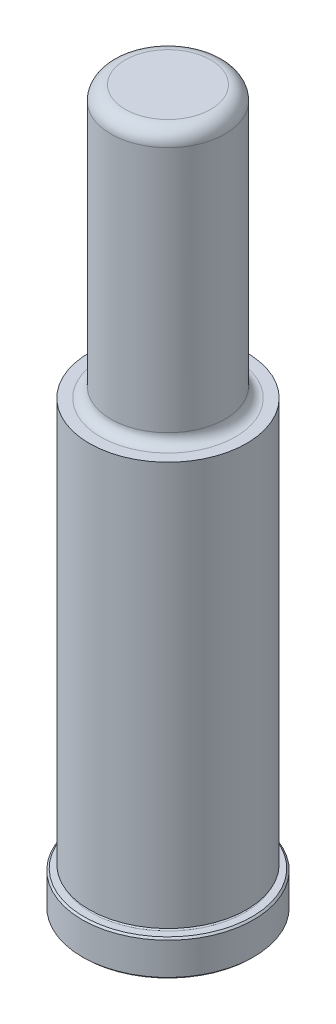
from build123d import *

# Parameters (mm, degrees)
CHAMFER1_SIZE = 0.381
FILLET7_R     = 3.175


with BuildPart() as part:
    # Sketch1 → Revolve1 (revolve)
    with BuildSketch(Plane(origin=(0, 0, 0), x_dir=(0, 0, -1), z_dir=(1, 0, 0)), mode=Mode.PRIVATE) as revolve1_sk:
        with BuildLine():
            Line((0, 0), (19.05, 0))
            Line((19.05, 0), (19.05, 7.9248))
            Line((19.05, 7.9248), (17.0688, 7.9248))
            ThreePointArc((17.0688, 7.9248), (16.6878, 8.3058), (17.0688, 8.6868))
            Line((17.0688, 8.6868), (17.4752, 8.6868))
            Line((17.4752, 8.6868), (17.4752, 98.425))
            Line((17.4752, 98.425), (14.9733, 98.425))
            ThreePointArc((14.9733, 98.425), (13.356853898, 99.094553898), (12.6873, 100.711))
            Line((12.6873, 100.711), (12.6873, 158.75))
            Line((12.6873, 158.75), (0, 158.75))
            Line((0, 158.75), (0, 0))
        make_face()
    revolve(revolve1_sk.sketch.rotate(Axis((0, 0, 0), (0, -1, 0)), 180), axis=Axis((0, 0, 0), (0, -1, 0)))

    # Chamfer1
    chamfer1_edges = [part.edges().sort_by_distance(p)[0] for p in [
        (0, 7.9248, -19.05),
        (0, 0, -19.05),
    ]]
    chamfer(chamfer1_edges, length=CHAMFER1_SIZE)

    # Fillet7
    fillet7_edges = [part.edges().sort_by_distance(p)[0] for p in [
        (0, 158.75, -12.6873),
    ]]
    fillet(fillet7_edges, radius=FILLET7_R)


solid = part.part
